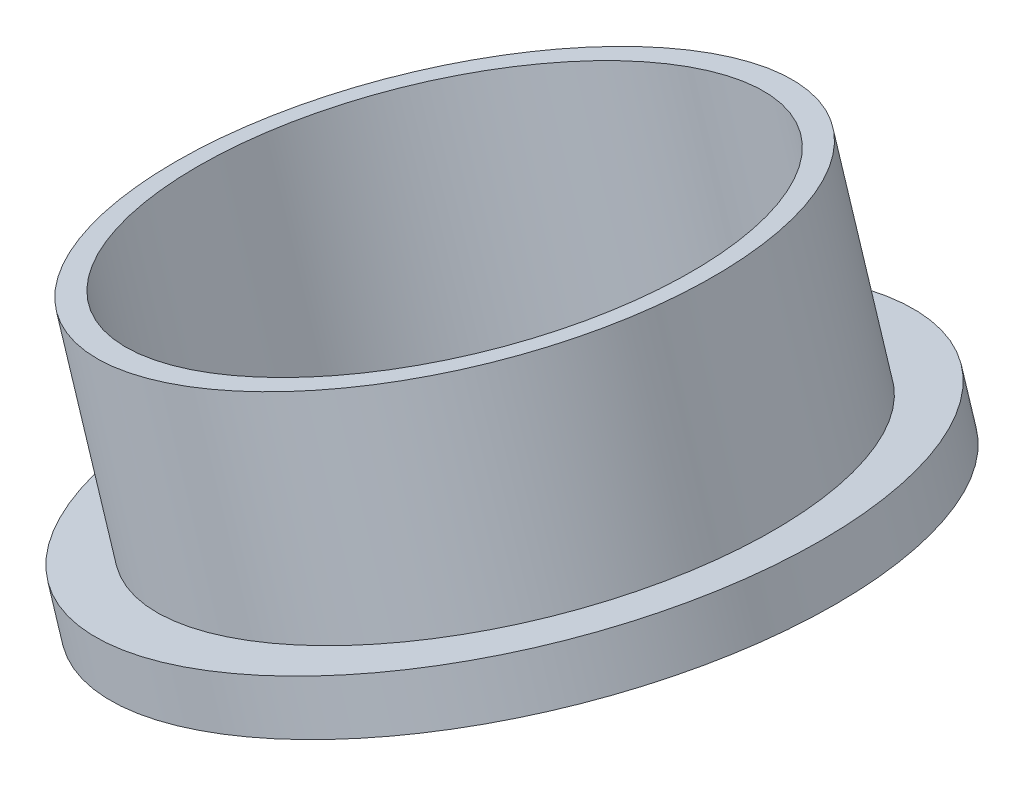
from build123d import *


with BuildPart() as part:
    # Sk_Cazoleta → Cazoleta (revolve)
    with BuildSketch(Plane.XY, mode=Mode.PRIVATE) as cazoleta_sk:
        Polygon((420.669370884, 409.515715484), (422.00457087, 409.936715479), (425.613142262, 398.492144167), (428.47428509, 399.394287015), (429.376427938, 396.533144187), (425.180085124, 395.210001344), align=None)
    revolve(cazoleta_sk.sketch.rotate(Axis((404.287856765, 409.593144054, 0), (0.3007142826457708, -0.9537142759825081, 0)), 180), axis=Axis((404.287856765, 409.593144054, 0), (0.3007142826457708, -0.9537142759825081, 0)))


solid = part.part
